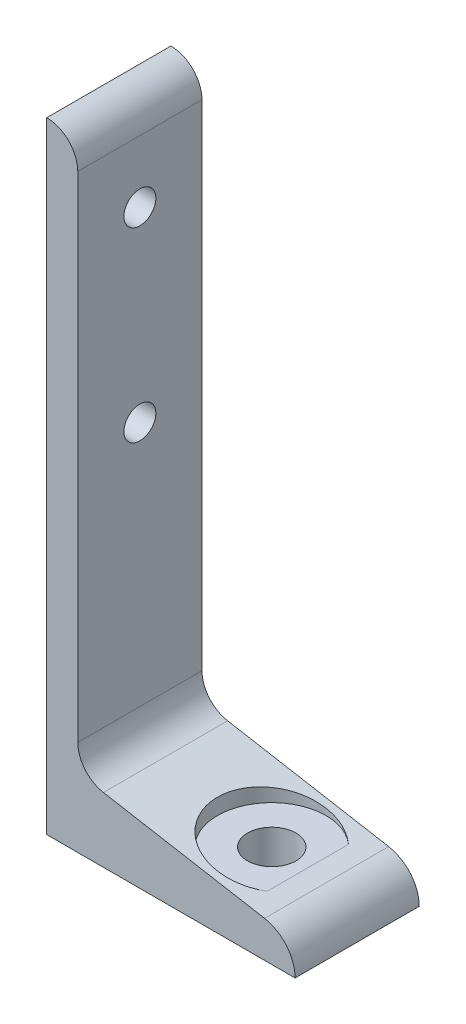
from build123d import *

# Parameters (mm, degrees)
BOSS_EXTRUDE1_DEPTH = 12.7
SKETCH2_R           = 4.953
CUT_EXTRUDE1_DEPTH  = 138.371503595
CUT_EXTRUDE2_START  = 8.128
SKETCH3_R           = 11.1125
CUT_EXTRUDE2_DEPTH  = 130.243503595
SKETCH4_R           = 3.2639
CUT_EXTRUDE3_DEPTH  = 138.371503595


with BuildPart() as part:
    # Sketch1 → Boss-Extrude1 (new, symmetric)
    with BuildSketch(Plane.XY):
        with BuildLine():
            Line((0, 0), (0, 127))
            ThreePointArc((0, 127), (4.490128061, 125.140128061), (6.35, 120.65))
            Line((6.35, 120.65), (6.35, 19.51601695))
            ThreePointArc((6.35, 19.51601695), (7.835617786, 15.434315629), (11.597334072, 13.262487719))
            Line((11.597334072, 13.262487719), (44.546470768, 7.452665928))
            ThreePointArc((44.546470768, 7.452665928), (49.029509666, 4.864382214), (50.8, 0))
            Line((50.8, 0), (0, 0))
        make_face()
    extrude(amount=BOSS_EXTRUDE1_DEPTH, both=True)

    # Sketch2 → Cut-Extrude1 (cut, through all)
    with BuildSketch(Plane(origin=(0, 0, 0), x_dir=(1, 0, 0), z_dir=(0, 1, 0))):
        with Locations((33.3248, 0)):
            Circle(SKETCH2_R)
    extrude(amount=CUT_EXTRUDE1_DEPTH, mode=Mode.SUBTRACT)

    # Sketch3 → Cut-Extrude2 (cut, through all)
    with BuildSketch(Plane(origin=(0, 0, 0), x_dir=(1, 0, 0), z_dir=(0, 1, 0)).offset(CUT_EXTRUDE2_START)):
        with Locations((33.3248, 0)):
            Circle(SKETCH3_R)
    extrude(amount=CUT_EXTRUDE2_DEPTH, mode=Mode.SUBTRACT)

    # Sketch4 → Cut-Extrude3 (cut, through all)
    with BuildSketch(Plane(origin=(0, 0, 0), x_dir=(0, 0, -1), z_dir=(1, 0, 0))):
        with Locations(Location((0, 69.85, 0), (0, 0, 270))):
            Circle(SKETCH4_R)
        with Locations(Location((0, 107.95, 0), (0, 0, 270))):
            Circle(SKETCH4_R)
    extrude(amount=CUT_EXTRUDE3_DEPTH, mode=Mode.SUBTRACT)


solid = part.part
